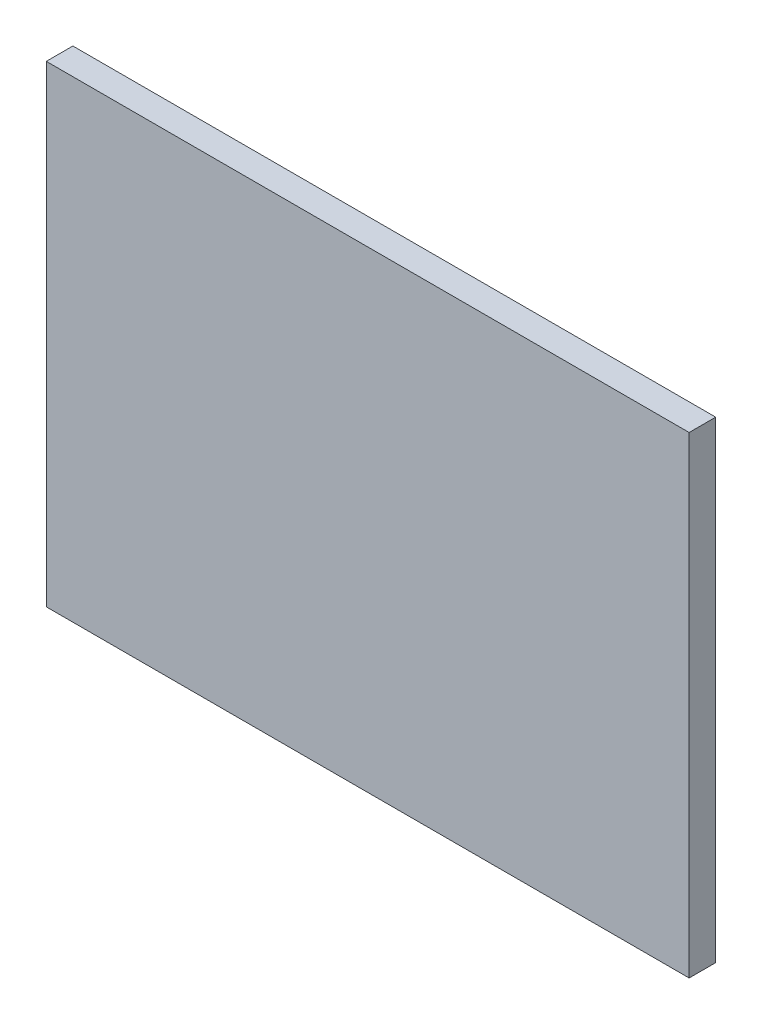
ISO-10303-21;
HEADER;
FILE_DESCRIPTION(('STEP AP214'),'2;1');
FILE_NAME('part.step','',(''),(''),'','','');
FILE_SCHEMA(('AUTOMOTIVE_DESIGN { 1 0 10303 214 1 1 1 1 }'));
ENDSEC;
DATA;
#1=APPLICATION_CONTEXT('core data for automotive mechanical design processes');
#2=APPLICATION_PROTOCOL_DEFINITION('international standard','automotive_design',2000,#1);
#3=PRODUCT_CONTEXT('',#1,'mechanical');
#4=PRODUCT('Part','Part','',(#3));
#5=PRODUCT_RELATED_PRODUCT_CATEGORY('part','',(#4));
#6=PRODUCT_DEFINITION_FORMATION('','',#4);
#7=PRODUCT_DEFINITION_CONTEXT('part definition',#1,'design');
#8=PRODUCT_DEFINITION('design','',#6,#7);
#9=PRODUCT_DEFINITION_SHAPE('','',#8);
#10=(LENGTH_UNIT() NAMED_UNIT(*) SI_UNIT(.MILLI.,.METRE.));
#11=(NAMED_UNIT(*) PLANE_ANGLE_UNIT() SI_UNIT($,.RADIAN.));
#12=(NAMED_UNIT(*) SI_UNIT($,.STERADIAN.) SOLID_ANGLE_UNIT());
#13=UNCERTAINTY_MEASURE_WITH_UNIT(LENGTH_MEASURE(1.E-05),#10,'distance_accuracy_value','');
#14=(GEOMETRIC_REPRESENTATION_CONTEXT(3) GLOBAL_UNCERTAINTY_ASSIGNED_CONTEXT((#13)) GLOBAL_UNIT_ASSIGNED_CONTEXT((#10,
#11,#12)) REPRESENTATION_CONTEXT('',''));
#15=CARTESIAN_POINT('',(0.,0.,0.));
#16=DIRECTION('',(0.,0.,1.));
#17=DIRECTION('',(1.,0.,0.));
#18=AXIS2_PLACEMENT_3D('',#15,#16,#17);
#19=CARTESIAN_POINT('',(-43.087339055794,19.1972103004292,1.5748));
#20=DIRECTION('',(1.,0.,0.));
#21=DIRECTION('',(0.,0.,-1.));
#22=AXIS2_PLACEMENT_3D('',#19,#20,#21);
#23=PLANE('',#22);
#24=DIRECTION('',(0.,-1.,0.));
#25=VECTOR('',#24,1.);
#26=CARTESIAN_POINT('',(-43.087339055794,19.1972103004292,0.));
#27=LINE('',#26,#25);
#28=CARTESIAN_POINT('',(-43.087339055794,19.1972103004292,0.));
#29=VERTEX_POINT('',#28);
#30=CARTESIAN_POINT('',(-43.087339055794,-8.80278969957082,0.));
#31=VERTEX_POINT('',#30);
#32=EDGE_CURVE('E75',#29,#31,#27,.T.);
#33=ORIENTED_EDGE('',*,*,#32,.T.);
#34=DIRECTION('',(0.,0.,-1.));
#35=VECTOR('',#34,1.);
#36=CARTESIAN_POINT('',(-43.087339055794,-8.80278969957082,1.5748));
#37=LINE('',#36,#35);
#38=CARTESIAN_POINT('',(-43.087339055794,-8.80278969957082,1.5748));
#39=VERTEX_POINT('',#38);
#40=EDGE_CURVE('E11',#39,#31,#37,.T.);
#41=ORIENTED_EDGE('',*,*,#40,.F.);
#42=DIRECTION('',(0.,-1.,0.));
#43=VECTOR('',#42,1.);
#44=CARTESIAN_POINT('',(-43.087339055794,19.1972103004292,1.5748));
#45=LINE('',#44,#43);
#46=CARTESIAN_POINT('',(-43.087339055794,19.1972103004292,1.5748));
#47=VERTEX_POINT('',#46);
#48=EDGE_CURVE('E93',#47,#39,#45,.T.);
#49=ORIENTED_EDGE('',*,*,#48,.F.);
#50=DIRECTION('',(0.,0.,-1.));
#51=VECTOR('',#50,1.);
#52=CARTESIAN_POINT('',(-43.087339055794,19.1972103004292,1.5748));
#53=LINE('',#52,#51);
#54=EDGE_CURVE('E87',#47,#29,#53,.T.);
#55=ORIENTED_EDGE('',*,*,#54,.T.);
#56=EDGE_LOOP('',(#33,#41,#49,#55));
#57=FACE_BOUND('',#56,.T.);
#58=ADVANCED_FACE('F31',(#57),#23,.F.);
#59=CARTESIAN_POINT('',(-43.087339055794,-8.80278969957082,1.5748));
#60=DIRECTION('',(0.,1.,0.));
#61=DIRECTION('',(0.,0.,1.));
#62=AXIS2_PLACEMENT_3D('',#59,#60,#61);
#63=PLANE('',#62);
#64=DIRECTION('',(1.,0.,0.));
#65=VECTOR('',#64,1.);
#66=CARTESIAN_POINT('',(-43.087339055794,-8.80278969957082,0.));
#67=LINE('',#66,#65);
#68=CARTESIAN_POINT('',(-4.98733905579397,-8.80278969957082,0.));
#69=VERTEX_POINT('',#68);
#70=EDGE_CURVE('E71',#31,#69,#67,.T.);
#71=ORIENTED_EDGE('',*,*,#70,.T.);
#72=DIRECTION('',(0.,0.,-1.));
#73=VECTOR('',#72,1.);
#74=CARTESIAN_POINT('',(-4.98733905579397,-8.80278969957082,1.5748));
#75=LINE('',#74,#73);
#76=CARTESIAN_POINT('',(-4.98733905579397,-8.80278969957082,1.5748));
#77=VERTEX_POINT('',#76);
#78=EDGE_CURVE('E38',#77,#69,#75,.T.);
#79=ORIENTED_EDGE('',*,*,#78,.F.);
#80=DIRECTION('',(1.,0.,0.));
#81=VECTOR('',#80,1.);
#82=CARTESIAN_POINT('',(-43.087339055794,-8.80278969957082,1.5748));
#83=LINE('',#82,#81);
#84=EDGE_CURVE('E83',#39,#77,#83,.T.);
#85=ORIENTED_EDGE('',*,*,#84,.F.);
#86=ORIENTED_EDGE('',*,*,#40,.T.);
#87=EDGE_LOOP('',(#71,#79,#85,#86));
#88=FACE_BOUND('',#87,.T.);
#89=ADVANCED_FACE('F82',(#88),#63,.F.);
#90=CARTESIAN_POINT('',(-4.98733905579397,19.1972103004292,1.5748));
#91=DIRECTION('',(-1.,0.,0.));
#92=DIRECTION('',(0.,0.,1.));
#93=AXIS2_PLACEMENT_3D('',#90,#91,#92);
#94=PLANE('',#93);
#95=DIRECTION('',(0.,1.,0.));
#96=VECTOR('',#95,1.);
#97=CARTESIAN_POINT('',(-4.98733905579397,19.1972103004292,0.));
#98=LINE('',#97,#96);
#99=CARTESIAN_POINT('',(-4.98733905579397,19.1972103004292,0.));
#100=VERTEX_POINT('',#99);
#101=EDGE_CURVE('E76',#69,#100,#98,.T.);
#102=ORIENTED_EDGE('',*,*,#101,.T.);
#103=DIRECTION('',(0.,0.,-1.));
#104=VECTOR('',#103,1.);
#105=CARTESIAN_POINT('',(-4.98733905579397,19.1972103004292,1.5748));
#106=LINE('',#105,#104);
#107=CARTESIAN_POINT('',(-4.98733905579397,19.1972103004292,1.5748));
#108=VERTEX_POINT('',#107);
#109=EDGE_CURVE('E99',#108,#100,#106,.T.);
#110=ORIENTED_EDGE('',*,*,#109,.F.);
#111=DIRECTION('',(0.,1.,0.));
#112=VECTOR('',#111,1.);
#113=CARTESIAN_POINT('',(-4.98733905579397,19.1972103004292,1.5748));
#114=LINE('',#113,#112);
#115=EDGE_CURVE('E50',#77,#108,#114,.T.);
#116=ORIENTED_EDGE('',*,*,#115,.F.);
#117=ORIENTED_EDGE('',*,*,#78,.T.);
#118=EDGE_LOOP('',(#102,#110,#116,#117));
#119=FACE_BOUND('',#118,.T.);
#120=ADVANCED_FACE('F102',(#119),#94,.F.);
#121=CARTESIAN_POINT('',(-43.087339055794,19.1972103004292,1.5748));
#122=DIRECTION('',(0.,-1.,0.));
#123=DIRECTION('',(0.,0.,-1.));
#124=AXIS2_PLACEMENT_3D('',#121,#122,#123);
#125=PLANE('',#124);
#126=DIRECTION('',(-1.,0.,0.));
#127=VECTOR('',#126,1.);
#128=CARTESIAN_POINT('',(-43.087339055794,19.1972103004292,0.));
#129=LINE('',#128,#127);
#130=EDGE_CURVE('E91',#100,#29,#129,.T.);
#131=ORIENTED_EDGE('',*,*,#130,.T.);
#132=ORIENTED_EDGE('',*,*,#54,.F.);
#133=DIRECTION('',(-1.,0.,0.));
#134=VECTOR('',#133,1.);
#135=CARTESIAN_POINT('',(-43.087339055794,19.1972103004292,1.5748));
#136=LINE('',#135,#134);
#137=EDGE_CURVE('E45',#108,#47,#136,.T.);
#138=ORIENTED_EDGE('',*,*,#137,.F.);
#139=ORIENTED_EDGE('',*,*,#109,.T.);
#140=EDGE_LOOP('',(#131,#132,#138,#139));
#141=FACE_BOUND('',#140,.T.);
#142=ADVANCED_FACE('F104',(#141),#125,.F.);
#143=CARTESIAN_POINT('',(-43.087339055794,-8.80278969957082,1.5748));
#144=DIRECTION('',(0.,0.,1.));
#145=DIRECTION('',(1.,0.,0.));
#146=AXIS2_PLACEMENT_3D('',#143,#144,#145);
#147=PLANE('',#146);
#148=ORIENTED_EDGE('',*,*,#48,.T.);
#149=ORIENTED_EDGE('',*,*,#84,.T.);
#150=ORIENTED_EDGE('',*,*,#115,.T.);
#151=ORIENTED_EDGE('',*,*,#137,.T.);
#152=EDGE_LOOP('',(#148,#149,#150,#151));
#153=FACE_BOUND('',#152,.T.);
#154=ADVANCED_FACE('F105',(#153),#147,.T.);
#155=CARTESIAN_POINT('',(-43.087339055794,-8.80278969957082,0.));
#156=DIRECTION('',(0.,0.,1.));
#157=DIRECTION('',(1.,0.,0.));
#158=AXIS2_PLACEMENT_3D('',#155,#156,#157);
#159=PLANE('',#158);
#160=ORIENTED_EDGE('',*,*,#32,.F.);
#161=ORIENTED_EDGE('',*,*,#130,.F.);
#162=ORIENTED_EDGE('',*,*,#101,.F.);
#163=ORIENTED_EDGE('',*,*,#70,.F.);
#164=EDGE_LOOP('',(#160,#161,#162,#163));
#165=FACE_BOUND('',#164,.T.);
#166=ADVANCED_FACE('F72',(#165),#159,.F.);
#167=CLOSED_SHELL('',(#58,#89,#120,#142,#154,#166));
#168=MANIFOLD_SOLID_BREP('B2',#167);
#169=ADVANCED_BREP_SHAPE_REPRESENTATION('',(#18,#168),#14);
#170=SHAPE_DEFINITION_REPRESENTATION(#9,#169);
ENDSEC;
END-ISO-10303-21;
